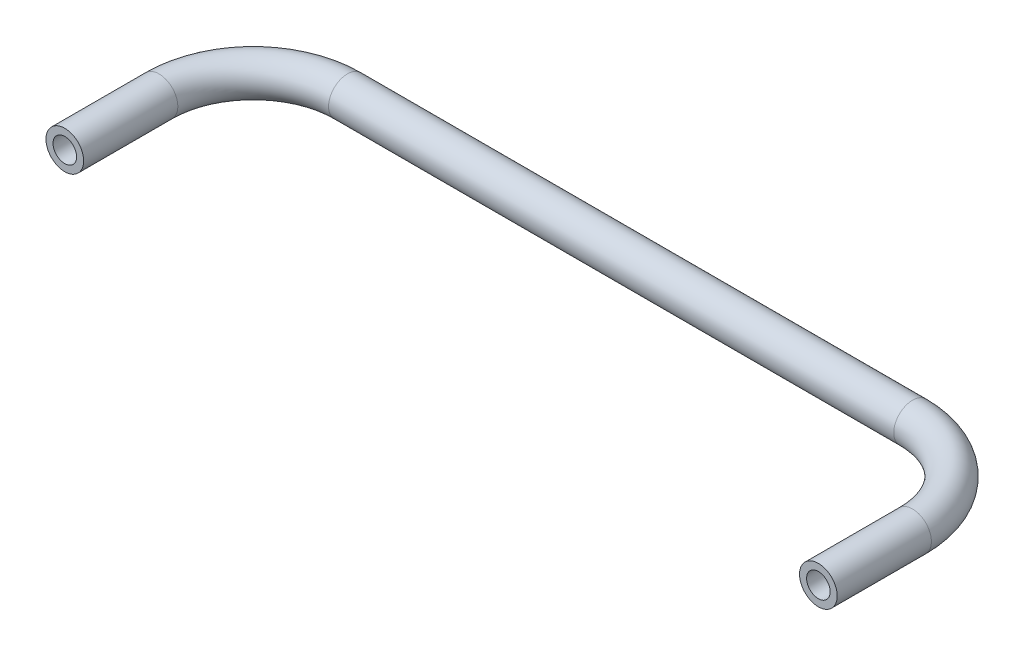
from build123d import *

# Parameters (mm, degrees)
SKETCH2_R                          = 3.81
F_3_16_0_1875_DIAMETER_HOLE1_D     = 4.7625
F_3_16_0_1875_DIAMETER_HOLE1_DEPTH = 19.05
F_3_16_0_1875_DIAMETER_HOLE1_TIP   = 1.430799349


with BuildPart() as part:
    # Sweep1: sweep along a path in Sketch1
    with BuildLine(Plane(origin=(0, 0, 0), x_dir=(1, 0, 0), z_dir=(0, 1, 0))) as sweep1_path:
        Line((76.2, -38.1), (76.2, -19.05))
        ThreePointArc((76.2, -19.05), (70.620384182, -5.579615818), (57.15, 0))
        Line((57.15, 0), (-57.15, 0))
        ThreePointArc((-57.15, 0), (-70.620384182, -5.579615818), (-76.2, -19.05))
        Line((-76.2, -19.05), (-76.2, -38.1))
    # Sketch2 → Sweep1 (sweep)
    with BuildSketch(Plane(origin=(-76.2, 0, 38.1), x_dir=(1, 0, 0), z_dir=(0, 0, 1))):
        Circle(SKETCH2_R)
    sweep(path=sweep1_path.line)

    # 3_16 _0.1875_ Diameter Hole1
    with Locations(Plane.XY.offset(38.1)):
        with Locations((-76.2, 0), (76.2, 0)):
            Hole(F_3_16_0_1875_DIAMETER_HOLE1_D / 2, depth=F_3_16_0_1875_DIAMETER_HOLE1_DEPTH)
            with Locations((0, 0, -(F_3_16_0_1875_DIAMETER_HOLE1_DEPTH + F_3_16_0_1875_DIAMETER_HOLE1_TIP / 2))):  # 118° drill point
                Cone(0, F_3_16_0_1875_DIAMETER_HOLE1_D / 2, F_3_16_0_1875_DIAMETER_HOLE1_TIP, mode=Mode.SUBTRACT)


solid = part.part
